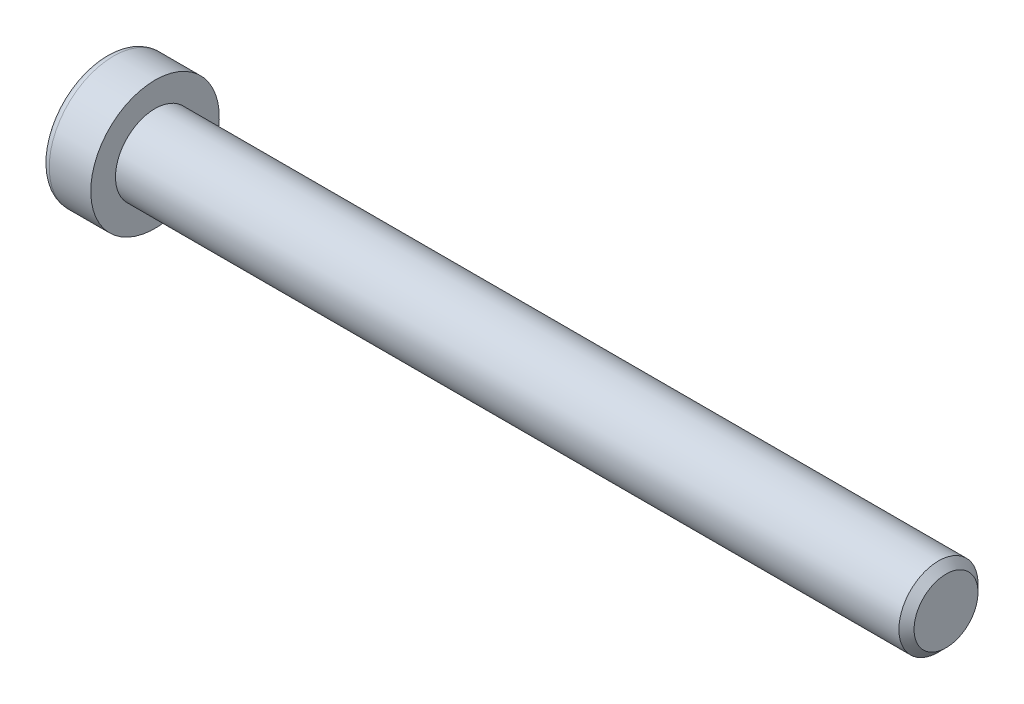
ISO-10303-21;
HEADER;
FILE_DESCRIPTION(('STEP AP214'),'2;1');
FILE_NAME('part.step','',(''),(''),'','','');
FILE_SCHEMA(('AUTOMOTIVE_DESIGN { 1 0 10303 214 1 1 1 1 }'));
ENDSEC;
DATA;
#1=APPLICATION_CONTEXT('core data for automotive mechanical design processes');
#2=APPLICATION_PROTOCOL_DEFINITION('international standard','automotive_design',2000,#1);
#3=PRODUCT_CONTEXT('',#1,'mechanical');
#4=PRODUCT('Part','Part','',(#3));
#5=PRODUCT_RELATED_PRODUCT_CATEGORY('part','',(#4));
#6=PRODUCT_DEFINITION_FORMATION('','',#4);
#7=PRODUCT_DEFINITION_CONTEXT('part definition',#1,'design');
#8=PRODUCT_DEFINITION('design','',#6,#7);
#9=PRODUCT_DEFINITION_SHAPE('','',#8);
#10=(LENGTH_UNIT() NAMED_UNIT(*) SI_UNIT(.MILLI.,.METRE.));
#11=(NAMED_UNIT(*) PLANE_ANGLE_UNIT() SI_UNIT($,.RADIAN.));
#12=(NAMED_UNIT(*) SI_UNIT($,.STERADIAN.) SOLID_ANGLE_UNIT());
#13=UNCERTAINTY_MEASURE_WITH_UNIT(LENGTH_MEASURE(1.E-05),#10,'distance_accuracy_value','');
#14=(GEOMETRIC_REPRESENTATION_CONTEXT(3) GLOBAL_UNCERTAINTY_ASSIGNED_CONTEXT((#13)) GLOBAL_UNIT_ASSIGNED_CONTEXT((#10,
#11,#12)) REPRESENTATION_CONTEXT('',''));
#15=CARTESIAN_POINT('',(0.,0.,0.));
#16=DIRECTION('',(0.,0.,1.));
#17=DIRECTION('',(1.,0.,0.));
#18=AXIS2_PLACEMENT_3D('',#15,#16,#17);
#19=CARTESIAN_POINT('',(-1.21000000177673,0.,0.));
#20=DIRECTION('',(-1.,0.,0.));
#21=DIRECTION('',(0.,0.,1.));
#22=AXIS2_PLACEMENT_3D('',#19,#20,#21);
#23=CONICAL_SURFACE('',#22,2.90407185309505,1.04719754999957);
#24=CARTESIAN_POINT('',(0.466666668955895,5.6843418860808E-11,0.));
#25=VERTEX_POINT('',#24);
#26=VERTEX_LOOP('',#25);
#27=FACE_BOUND('',#26,.T.);
#28=CARTESIAN_POINT('',(-1.20000000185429,2.50000000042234,1.44337567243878));
#29=CARTESIAN_POINT('',(-1.16336943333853,2.50000000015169,1.31652043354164));
#30=CARTESIAN_POINT('',(-1.13005584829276,2.50000000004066,1.18857018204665));
#31=CARTESIAN_POINT('',(-1.07190798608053,2.49999999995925,0.93045430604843));
#32=CARTESIAN_POINT('',(-1.0470942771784,2.49999999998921,0.800284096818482));
#33=CARTESIAN_POINT('',(-1.00846995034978,2.50000000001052,0.541556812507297));
#34=CARTESIAN_POINT('',(-0.994402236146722,2.50000000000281,0.413039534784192));
#35=CARTESIAN_POINT('',(-0.977611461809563,2.4999999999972,0.155400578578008));
#36=CARTESIAN_POINT('',(-0.97487449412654,2.4999999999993,0.026279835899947));
#37=CARTESIAN_POINT('',(-0.980582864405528,2.50000000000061,-0.214968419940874));
#38=CARTESIAN_POINT('',(-0.987626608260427,2.50000000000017,-0.327132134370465));
#39=CARTESIAN_POINT('',(-1.00994662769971,2.49999999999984,-0.550728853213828));
#40=CARTESIAN_POINT('',(-1.02523052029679,2.49999999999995,-0.662161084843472));
#41=CARTESIAN_POINT('',(-1.06343729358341,2.50000000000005,-0.886218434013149));
#42=CARTESIAN_POINT('',(-1.0865220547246,2.50000000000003,-0.998815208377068));
#43=CARTESIAN_POINT('',(-1.13891470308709,2.49999999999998,-1.22232986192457));
#44=CARTESIAN_POINT('',(-1.16821028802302,2.49999999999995,-1.33325060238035));
#45=CARTESIAN_POINT('',(-1.20000000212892,2.5,-1.44337567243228));
#46=B_SPLINE_CURVE_WITH_KNOTS('',3,(#28,#29,#30,#31,#32,#33,#34,#35,#36,#37,#38,#39,#40,#41,#42,
#43,#44,#45),.UNSPECIFIED.,.F.,.F.,(4,2,2,2,2,2,2,2,4),(0.,0.396270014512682,0.793492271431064,
1.18088450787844,1.56780111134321,1.90463472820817,2.2417802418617,2.586402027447,
2.93034746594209),.UNSPECIFIED.);
#47=CARTESIAN_POINT('',(-1.20000000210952,2.49999999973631,1.44337567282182));
#48=VERTEX_POINT('',#47);
#49=CARTESIAN_POINT('',(-1.20000000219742,2.5,-1.44337567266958));
#50=VERTEX_POINT('',#49);
#51=EDGE_CURVE('E20',#48,#50,#46,.T.);
#52=ORIENTED_EDGE('',*,*,#51,.T.);
#53=CARTESIAN_POINT('',(-1.20000000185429,2.4999999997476,-1.44337567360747));
#54=CARTESIAN_POINT('',(-1.16336943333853,2.3901401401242,-1.50680329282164));
#55=CARTESIAN_POINT('',(-1.13005584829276,2.27933197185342,-1.57077841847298));
#56=CARTESIAN_POINT('',(-1.07190798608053,2.05579706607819,-1.69983635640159));
#57=CARTESIAN_POINT('',(-1.0470942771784,1.9430663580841,-1.76492146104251));
#58=CARTESIAN_POINT('',(-1.00846995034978,1.71900195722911,-1.89428510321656));
#59=CARTESIAN_POINT('',(-0.994402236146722,1.60770272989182,-1.95854374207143));
#60=CARTESIAN_POINT('',(-0.977611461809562,1.38458084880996,-2.08736322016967));
#61=CARTESIAN_POINT('',(-0.974874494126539,1.27275900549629,-2.15192359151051));
#62=CARTESIAN_POINT('',(-0.980582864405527,1.06383188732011,-2.27254771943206));
#63=CARTESIAN_POINT('',(-0.987626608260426,0.966695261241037,-2.32862957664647));
#64=CARTESIAN_POINT('',(-1.00994662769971,0.773054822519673,-2.44042793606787));
#65=CARTESIAN_POINT('',(-1.02523052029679,0.676551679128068,-2.49614405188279));
#66=CARTESIAN_POINT('',(-1.06343729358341,0.482512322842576,-2.60817272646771));
#67=CARTESIAN_POINT('',(-1.0865220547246,0.385000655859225,-2.66447111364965));
#68=CARTESIAN_POINT('',(-1.13891470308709,0.191431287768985,-2.77622844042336));
#69=CARTESIAN_POINT('',(-1.16821028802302,0.0953711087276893,-2.83168881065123));
#70=CARTESIAN_POINT('',(-1.20000000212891,4.69203677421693E-10,-2.88675134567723));
#71=B_SPLINE_CURVE_WITH_KNOTS('',3,(#53,#54,#55,#56,#57,#58,#59,#60,#61,#62,#63,#64,#65,#66,#67,
#68,#69,#70),.UNSPECIFIED.,.F.,.F.,(4,2,2,2,2,2,2,2,4),(0.,0.396270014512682,0.793492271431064,
1.18088450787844,1.56780111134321,1.90463472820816,2.2417802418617,2.586402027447,
2.93034746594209),.UNSPECIFIED.);
#72=CARTESIAN_POINT('',(-1.20000000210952,0.,-2.88675134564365));
#73=VERTEX_POINT('',#72);
#74=EDGE_CURVE('E81',#50,#73,#71,.T.);
#75=ORIENTED_EDGE('',*,*,#74,.T.);
#76=CARTESIAN_POINT('',(-1.20000000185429,-6.74740305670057E-10,-2.88675134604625));
#77=CARTESIAN_POINT('',(-1.16336943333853,-0.109859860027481,-2.82332372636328));
#78=CARTESIAN_POINT('',(-1.13005584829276,-0.220668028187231,-2.75934860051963));
#79=CARTESIAN_POINT('',(-1.07190798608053,-0.44420293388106,-2.63029066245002));
#80=CARTESIAN_POINT('',(-1.0470942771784,-0.556933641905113,-2.565205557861));
#81=CARTESIAN_POINT('',(-1.00846995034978,-0.780998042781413,-2.43584191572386));
#82=CARTESIAN_POINT('',(-0.994402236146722,-0.892297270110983,-2.37158327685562));
#83=CARTESIAN_POINT('',(-0.977611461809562,-1.11541915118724,-2.24276379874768));
#84=CARTESIAN_POINT('',(-0.974874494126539,-1.22724099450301,-2.17820342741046));
#85=CARTESIAN_POINT('',(-0.980582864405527,-1.4361681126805,-2.05757929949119));
#86=CARTESIAN_POINT('',(-0.987626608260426,-1.53330473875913,-2.00149744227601));
#87=CARTESIAN_POINT('',(-1.00994662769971,-1.72694517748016,-1.88969908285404));
#88=CARTESIAN_POINT('',(-1.02523052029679,-1.82344832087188,-1.83398296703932));
#89=CARTESIAN_POINT('',(-1.06343729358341,-2.01748767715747,-1.72195429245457));
#90=CARTESIAN_POINT('',(-1.0865220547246,-2.1149993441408,-1.66565590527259));
#91=CARTESIAN_POINT('',(-1.13891470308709,-2.30856871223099,-1.55389857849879));
#92=CARTESIAN_POINT('',(-1.16821028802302,-2.40462889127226,-1.49843820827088));
#93=CARTESIAN_POINT('',(-1.20000000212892,-2.4999999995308,-1.44337567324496));
#94=B_SPLINE_CURVE_WITH_KNOTS('',3,(#76,#77,#78,#79,#80,#81,#82,#83,#84,#85,#86,#87,#88,#89,#90,
#91,#92,#93),.UNSPECIFIED.,.F.,.F.,(4,2,2,2,2,2,2,2,4),(0.,0.396270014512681,0.793492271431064,
1.18088450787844,1.56780111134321,1.90463472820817,2.2417802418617,2.58640202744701,
2.93034746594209),.UNSPECIFIED.);
#95=CARTESIAN_POINT('',(-1.20000000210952,-2.49999999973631,-1.44337567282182));
#96=VERTEX_POINT('',#95);
#97=EDGE_CURVE('E106',#73,#96,#94,.T.);
#98=ORIENTED_EDGE('',*,*,#97,.T.);
#99=CARTESIAN_POINT('',(-1.20000000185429,-2.50000000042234,-1.44337567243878));
#100=CARTESIAN_POINT('',(-1.16336943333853,-2.50000000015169,-1.31652043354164));
#101=CARTESIAN_POINT('',(-1.13005584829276,-2.50000000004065,-1.18857018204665));
#102=CARTESIAN_POINT('',(-1.07190798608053,-2.49999999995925,-0.930454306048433));
#103=CARTESIAN_POINT('',(-1.0470942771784,-2.49999999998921,-0.800284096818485));
#104=CARTESIAN_POINT('',(-1.00846995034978,-2.50000000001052,-0.5415568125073));
#105=CARTESIAN_POINT('',(-0.994402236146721,-2.5000000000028,-0.413039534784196));
#106=CARTESIAN_POINT('',(-0.977611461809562,-2.4999999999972,-0.155400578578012));
#107=CARTESIAN_POINT('',(-0.974874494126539,-2.4999999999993,-0.0262798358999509));
#108=CARTESIAN_POINT('',(-0.980582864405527,-2.50000000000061,0.214968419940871));
#109=CARTESIAN_POINT('',(-0.987626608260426,-2.50000000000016,0.327132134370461));
#110=CARTESIAN_POINT('',(-1.00994662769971,-2.49999999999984,0.550728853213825));
#111=CARTESIAN_POINT('',(-1.02523052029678,-2.49999999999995,0.662161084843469));
#112=CARTESIAN_POINT('',(-1.06343729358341,-2.50000000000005,0.886218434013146));
#113=CARTESIAN_POINT('',(-1.0865220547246,-2.50000000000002,0.998815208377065));
#114=CARTESIAN_POINT('',(-1.13891470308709,-2.49999999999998,1.22232986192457));
#115=CARTESIAN_POINT('',(-1.16821028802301,-2.49999999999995,1.33325060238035));
#116=CARTESIAN_POINT('',(-1.20000000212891,-2.5,1.44337567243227));
#117=B_SPLINE_CURVE_WITH_KNOTS('',3,(#99,#100,#101,#102,#103,#104,#105,#106,#107,#108,#109,#110,
#111,#112,#113,#114,#115,#116),.UNSPECIFIED.,.F.,.F.,(4,2,2,2,2,2,2,2,4),(0.,0.396270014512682,
0.793492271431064,1.18088450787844,1.56780111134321,1.90463472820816,2.2417802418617,
2.586402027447,2.93034746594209),.UNSPECIFIED.);
#118=CARTESIAN_POINT('',(-1.20000000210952,-2.49999999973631,1.44337567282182));
#119=VERTEX_POINT('',#118);
#120=EDGE_CURVE('E130',#96,#119,#117,.T.);
#121=ORIENTED_EDGE('',*,*,#120,.T.);
#122=CARTESIAN_POINT('',(-1.20000000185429,-2.4999999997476,1.44337567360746));
#123=CARTESIAN_POINT('',(-1.16336943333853,-2.39014014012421,1.50680329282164));
#124=CARTESIAN_POINT('',(-1.13005584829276,-2.27933197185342,1.57077841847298));
#125=CARTESIAN_POINT('',(-1.07190798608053,-2.05579706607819,1.69983635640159));
#126=CARTESIAN_POINT('',(-1.0470942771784,-1.9430663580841,1.76492146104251));
#127=CARTESIAN_POINT('',(-1.00846995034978,-1.71900195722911,1.89428510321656));
#128=CARTESIAN_POINT('',(-0.994402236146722,-1.60770272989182,1.95854374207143));
#129=CARTESIAN_POINT('',(-0.977611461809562,-1.38458084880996,2.08736322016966));
#130=CARTESIAN_POINT('',(-0.974874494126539,-1.27275900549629,2.15192359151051));
#131=CARTESIAN_POINT('',(-0.980582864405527,-1.06383188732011,2.27254771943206));
#132=CARTESIAN_POINT('',(-0.987626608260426,-0.966695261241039,2.32862957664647));
#133=CARTESIAN_POINT('',(-1.00994662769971,-0.773054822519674,2.44042793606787));
#134=CARTESIAN_POINT('',(-1.02523052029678,-0.676551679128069,2.49614405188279));
#135=CARTESIAN_POINT('',(-1.06343729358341,-0.482512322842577,2.60817272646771));
#136=CARTESIAN_POINT('',(-1.0865220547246,-0.385000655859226,2.66447111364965));
#137=CARTESIAN_POINT('',(-1.13891470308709,-0.191431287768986,2.77622844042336));
#138=CARTESIAN_POINT('',(-1.16821028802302,-0.0953711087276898,2.83168881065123));
#139=CARTESIAN_POINT('',(-1.20000000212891,-4.69203937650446E-10,2.88675134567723));
#140=B_SPLINE_CURVE_WITH_KNOTS('',3,(#122,#123,#124,#125,#126,#127,#128,#129,#130,#131,#132,
#133,#134,#135,#136,#137,#138,#139),.UNSPECIFIED.,.F.,.F.,(4,2,2,2,2,2,2,2,4),(0.,
0.396270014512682,0.793492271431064,1.18088450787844,1.56780111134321,1.90463472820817,
2.2417802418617,2.58640202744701,2.93034746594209),.UNSPECIFIED.);
#141=CARTESIAN_POINT('',(-1.20000000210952,0.,2.88675134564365));
#142=VERTEX_POINT('',#141);
#143=EDGE_CURVE('E138',#119,#142,#140,.T.);
#144=ORIENTED_EDGE('',*,*,#143,.T.);
#145=CARTESIAN_POINT('',(-1.20000000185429,6.74739340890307E-10,2.88675134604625));
#146=CARTESIAN_POINT('',(-1.16336943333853,0.10985986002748,2.82332372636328));
#147=CARTESIAN_POINT('',(-1.13005584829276,0.22066802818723,2.75934860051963));
#148=CARTESIAN_POINT('',(-1.07190798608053,0.444202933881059,2.63029066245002));
#149=CARTESIAN_POINT('',(-1.0470942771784,0.556933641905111,2.565205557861));
#150=CARTESIAN_POINT('',(-1.00846995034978,0.780998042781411,2.43584191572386));
#151=CARTESIAN_POINT('',(-0.994402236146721,0.892297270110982,2.37158327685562));
#152=CARTESIAN_POINT('',(-0.977611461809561,1.11541915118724,2.24276379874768));
#153=CARTESIAN_POINT('',(-0.974874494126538,1.227240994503,2.17820342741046));
#154=CARTESIAN_POINT('',(-0.980582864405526,1.4361681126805,2.05757929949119));
#155=CARTESIAN_POINT('',(-0.987626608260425,1.53330473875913,2.00149744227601));
#156=CARTESIAN_POINT('',(-1.00994662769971,1.72694517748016,1.88969908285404));
#157=CARTESIAN_POINT('',(-1.02523052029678,1.82344832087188,1.83398296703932));
#158=CARTESIAN_POINT('',(-1.06343729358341,2.01748767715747,1.72195429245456));
#159=CARTESIAN_POINT('',(-1.0865220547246,2.1149993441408,1.66565590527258));
#160=CARTESIAN_POINT('',(-1.13891470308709,2.30856871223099,1.55389857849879));
#161=CARTESIAN_POINT('',(-1.16821028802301,2.40462889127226,1.49843820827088));
#162=CARTESIAN_POINT('',(-1.20000000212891,2.4999999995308,1.44337567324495));
#163=B_SPLINE_CURVE_WITH_KNOTS('',3,(#145,#146,#147,#148,#149,#150,#151,#152,#153,#154,#155,
#156,#157,#158,#159,#160,#161,#162),.UNSPECIFIED.,.F.,.F.,(4,2,2,2,2,2,2,2,4),(0.,
0.396270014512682,0.793492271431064,1.18088450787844,1.56780111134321,1.90463472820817,
2.2417802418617,2.58640202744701,2.93034746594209),.UNSPECIFIED.);
#164=EDGE_CURVE('E83',#142,#48,#163,.T.);
#165=ORIENTED_EDGE('',*,*,#164,.T.);
#166=EDGE_LOOP('',(#52,#75,#98,#121,#144,#165));
#167=FACE_BOUND('',#166,.T.);
#168=ADVANCED_FACE('F16',(#27,#167),#23,.F.);
#169=CARTESIAN_POINT('',(-5.,2.5,1.44337567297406));
#170=DIRECTION('',(0.,1.,0.));
#171=DIRECTION('',(0.,0.,1.));
#172=AXIS2_PLACEMENT_3D('',#169,#170,#171);
#173=PLANE('',#172);
#174=DIRECTION('',(1.,0.,0.));
#175=VECTOR('',#174,1.);
#176=CARTESIAN_POINT('',(-5.,2.5,1.44337567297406));
#177=LINE('',#176,#175);
#178=CARTESIAN_POINT('',(-5.,2.5,1.44337567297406));
#179=VERTEX_POINT('',#178);
#180=EDGE_CURVE('E85',#48,#179,#177,.F.);
#181=ORIENTED_EDGE('',*,*,#180,.T.);
#182=DIRECTION('',(0.,0.,1.));
#183=VECTOR('',#182,1.);
#184=CARTESIAN_POINT('',(-5.,2.5,0.));
#185=LINE('',#184,#183);
#186=CARTESIAN_POINT('',(-5.,2.5,-1.44337567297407));
#187=VERTEX_POINT('',#186);
#188=EDGE_CURVE('E90',#187,#179,#185,.T.);
#189=ORIENTED_EDGE('',*,*,#188,.F.);
#190=DIRECTION('',(1.,0.,0.));
#191=VECTOR('',#190,1.);
#192=CARTESIAN_POINT('',(-5.,2.5,-1.44337567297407));
#193=LINE('',#192,#191);
#194=EDGE_CURVE('E88',#187,#50,#193,.T.);
#195=ORIENTED_EDGE('',*,*,#194,.T.);
#196=ORIENTED_EDGE('',*,*,#51,.F.);
#197=EDGE_LOOP('',(#181,#189,#195,#196));
#198=FACE_BOUND('',#197,.T.);
#199=ADVANCED_FACE('F77',(#198),#173,.F.);
#200=CARTESIAN_POINT('',(-5.,0.,2.88675134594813));
#201=DIRECTION('',(0.,0.500000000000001,0.866025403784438));
#202=DIRECTION('',(0.,-0.866025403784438,0.500000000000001));
#203=AXIS2_PLACEMENT_3D('',#200,#201,#202);
#204=PLANE('',#203);
#205=DIRECTION('',(1.,0.,0.));
#206=VECTOR('',#205,1.);
#207=CARTESIAN_POINT('',(-5.,0.,2.88675134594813));
#208=LINE('',#207,#206);
#209=CARTESIAN_POINT('',(-5.,0.,2.88675134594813));
#210=VERTEX_POINT('',#209);
#211=EDGE_CURVE('E142',#142,#210,#208,.F.);
#212=ORIENTED_EDGE('',*,*,#211,.T.);
#213=DIRECTION('',(0.,-0.866025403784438,0.500000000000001));
#214=VECTOR('',#213,1.);
#215=CARTESIAN_POINT('',(-5.,2.5,1.44337567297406));
#216=LINE('',#215,#214);
#217=EDGE_CURVE('E96',#179,#210,#216,.T.);
#218=ORIENTED_EDGE('',*,*,#217,.F.);
#219=ORIENTED_EDGE('',*,*,#180,.F.);
#220=ORIENTED_EDGE('',*,*,#164,.F.);
#221=EDGE_LOOP('',(#212,#218,#219,#220));
#222=FACE_BOUND('',#221,.T.);
#223=ADVANCED_FACE('F146',(#222),#204,.F.);
#224=CARTESIAN_POINT('',(-5.,-2.5,1.44337567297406));
#225=DIRECTION('',(0.,-0.5,0.866025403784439));
#226=DIRECTION('',(0.,-0.866025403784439,-0.5));
#227=AXIS2_PLACEMENT_3D('',#224,#225,#226);
#228=PLANE('',#227);
#229=DIRECTION('',(1.,0.,0.));
#230=VECTOR('',#229,1.);
#231=CARTESIAN_POINT('',(-5.,-2.5,1.44337567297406));
#232=LINE('',#231,#230);
#233=CARTESIAN_POINT('',(-5.,-2.5,1.44337567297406));
#234=VERTEX_POINT('',#233);
#235=EDGE_CURVE('E137',#119,#234,#232,.F.);
#236=ORIENTED_EDGE('',*,*,#235,.T.);
#237=DIRECTION('',(0.,-0.866025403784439,-0.5));
#238=VECTOR('',#237,1.);
#239=CARTESIAN_POINT('',(-5.,0.,2.88675134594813));
#240=LINE('',#239,#238);
#241=EDGE_CURVE('E224',#210,#234,#240,.T.);
#242=ORIENTED_EDGE('',*,*,#241,.F.);
#243=ORIENTED_EDGE('',*,*,#211,.F.);
#244=ORIENTED_EDGE('',*,*,#143,.F.);
#245=EDGE_LOOP('',(#236,#242,#243,#244));
#246=FACE_BOUND('',#245,.T.);
#247=ADVANCED_FACE('F126',(#246),#228,.F.);
#248=CARTESIAN_POINT('',(-5.,-2.5,-1.44337567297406));
#249=DIRECTION('',(0.,-1.,0.));
#250=DIRECTION('',(0.,0.,-1.));
#251=AXIS2_PLACEMENT_3D('',#248,#249,#250);
#252=PLANE('',#251);
#253=DIRECTION('',(1.,0.,0.));
#254=VECTOR('',#253,1.);
#255=CARTESIAN_POINT('',(-5.,-2.5,-1.44337567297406));
#256=LINE('',#255,#254);
#257=CARTESIAN_POINT('',(-5.,-2.5,-1.44337567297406));
#258=VERTEX_POINT('',#257);
#259=EDGE_CURVE('E136',#96,#258,#256,.F.);
#260=ORIENTED_EDGE('',*,*,#259,.T.);
#261=DIRECTION('',(0.,0.,1.));
#262=VECTOR('',#261,1.);
#263=CARTESIAN_POINT('',(-5.,-2.5,0.));
#264=LINE('',#263,#262);
#265=EDGE_CURVE('E221',#234,#258,#264,.F.);
#266=ORIENTED_EDGE('',*,*,#265,.F.);
#267=ORIENTED_EDGE('',*,*,#235,.F.);
#268=ORIENTED_EDGE('',*,*,#120,.F.);
#269=EDGE_LOOP('',(#260,#266,#267,#268));
#270=FACE_BOUND('',#269,.T.);
#271=ADVANCED_FACE('F122',(#270),#252,.F.);
#272=CARTESIAN_POINT('',(-5.,0.,-2.88675134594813));
#273=DIRECTION('',(0.,-0.5,-0.866025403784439));
#274=DIRECTION('',(0.,0.866025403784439,-0.5));
#275=AXIS2_PLACEMENT_3D('',#272,#273,#274);
#276=PLANE('',#275);
#277=DIRECTION('',(1.,0.,0.));
#278=VECTOR('',#277,1.);
#279=CARTESIAN_POINT('',(-5.,0.,-2.88675134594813));
#280=LINE('',#279,#278);
#281=CARTESIAN_POINT('',(-5.,0.,-2.88675134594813));
#282=VERTEX_POINT('',#281);
#283=EDGE_CURVE('E39',#73,#282,#280,.F.);
#284=ORIENTED_EDGE('',*,*,#283,.T.);
#285=DIRECTION('',(0.,0.866025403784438,-0.500000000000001));
#286=VECTOR('',#285,1.);
#287=CARTESIAN_POINT('',(-5.,-2.5,-1.44337567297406));
#288=LINE('',#287,#286);
#289=EDGE_CURVE('E218',#258,#282,#288,.T.);
#290=ORIENTED_EDGE('',*,*,#289,.F.);
#291=ORIENTED_EDGE('',*,*,#259,.F.);
#292=ORIENTED_EDGE('',*,*,#97,.F.);
#293=EDGE_LOOP('',(#284,#290,#291,#292));
#294=FACE_BOUND('',#293,.T.);
#295=ADVANCED_FACE('F116',(#294),#276,.F.);
#296=CARTESIAN_POINT('',(-5.,2.5,-1.44337567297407));
#297=DIRECTION('',(0.,0.5,-0.866025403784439));
#298=DIRECTION('',(0.,0.866025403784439,0.5));
#299=AXIS2_PLACEMENT_3D('',#296,#297,#298);
#300=PLANE('',#299);
#301=ORIENTED_EDGE('',*,*,#194,.F.);
#302=DIRECTION('',(0.,0.866025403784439,0.5));
#303=VECTOR('',#302,1.);
#304=CARTESIAN_POINT('',(-5.,0.,-2.88675134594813));
#305=LINE('',#304,#303);
#306=EDGE_CURVE('E216',#282,#187,#305,.T.);
#307=ORIENTED_EDGE('',*,*,#306,.F.);
#308=ORIENTED_EDGE('',*,*,#283,.F.);
#309=ORIENTED_EDGE('',*,*,#74,.F.);
#310=EDGE_LOOP('',(#301,#307,#308,#309));
#311=FACE_BOUND('',#310,.T.);
#312=ADVANCED_FACE('F94',(#311),#300,.F.);
#313=CARTESIAN_POINT('',(-5.,4.69337567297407,0.));
#314=DIRECTION('',(-1.,0.,0.));
#315=DIRECTION('',(0.,0.,1.));
#316=AXIS2_PLACEMENT_3D('',#313,#314,#315);
#317=PLANE('',#316);
#318=ORIENTED_EDGE('',*,*,#289,.T.);
#319=ORIENTED_EDGE('',*,*,#306,.T.);
#320=ORIENTED_EDGE('',*,*,#188,.T.);
#321=ORIENTED_EDGE('',*,*,#217,.T.);
#322=ORIENTED_EDGE('',*,*,#241,.T.);
#323=ORIENTED_EDGE('',*,*,#265,.T.);
#324=EDGE_LOOP('',(#318,#319,#320,#321,#322,#323));
#325=FACE_BOUND('',#324,.T.);
#326=CARTESIAN_POINT('',(-5.,0.,0.));
#327=DIRECTION('',(1.,0.,0.));
#328=DIRECTION('',(0.,1.,0.));
#329=AXIS2_PLACEMENT_3D('',#326,#327,#328);
#330=CIRCLE('',#329,5.7);
#331=CARTESIAN_POINT('',(-5.,5.7,0.));
#332=VERTEX_POINT('',#331);
#333=EDGE_CURVE('E193',#332,#332,#330,.T.);
#334=ORIENTED_EDGE('',*,*,#333,.F.);
#335=EDGE_LOOP('',(#334));
#336=FACE_BOUND('',#335,.T.);
#337=ADVANCED_FACE('F115',(#325,#336),#317,.T.);
#338=CARTESIAN_POINT('',(-4.2,0.,0.));
#339=DIRECTION('',(1.,0.,0.));
#340=DIRECTION('',(0.,0.,-1.));
#341=AXIS2_PLACEMENT_3D('',#338,#339,#340);
#342=TOROIDAL_SURFACE('',#341,5.7,0.8);
#343=CARTESIAN_POINT('',(-4.2,0.,0.));
#344=DIRECTION('',(1.,0.,0.));
#345=DIRECTION('',(0.,1.,0.));
#346=AXIS2_PLACEMENT_3D('',#343,#344,#345);
#347=CIRCLE('',#346,6.5);
#348=CARTESIAN_POINT('',(-4.2,6.5,0.));
#349=VERTEX_POINT('',#348);
#350=EDGE_CURVE('E237',#349,#349,#347,.T.);
#351=ORIENTED_EDGE('',*,*,#350,.F.);
#352=EDGE_LOOP('',(#351));
#353=FACE_BOUND('',#352,.T.);
#354=ORIENTED_EDGE('',*,*,#333,.T.);
#355=EDGE_LOOP('',(#354));
#356=FACE_BOUND('',#355,.T.);
#357=ADVANCED_FACE('F177',(#353,#356),#342,.T.);
#358=CARTESIAN_POINT('',(-2.5,0.,0.));
#359=DIRECTION('',(1.,0.,0.));
#360=DIRECTION('',(0.,1.,0.));
#361=AXIS2_PLACEMENT_3D('',#358,#359,#360);
#362=CYLINDRICAL_SURFACE('',#361,6.5);
#363=ORIENTED_EDGE('',*,*,#350,.T.);
#364=EDGE_LOOP('',(#363));
#365=FACE_BOUND('',#364,.T.);
#366=CARTESIAN_POINT('',(0.,0.,0.));
#367=DIRECTION('',(1.,0.,0.));
#368=DIRECTION('',(0.,1.,0.));
#369=AXIS2_PLACEMENT_3D('',#366,#367,#368);
#370=CIRCLE('',#369,6.5);
#371=CARTESIAN_POINT('',(0.,6.5,0.));
#372=VERTEX_POINT('',#371);
#373=EDGE_CURVE('E104',#372,#372,#370,.T.);
#374=ORIENTED_EDGE('',*,*,#373,.F.);
#375=EDGE_LOOP('',(#374));
#376=FACE_BOUND('',#375,.T.);
#377=ADVANCED_FACE('F174',(#365,#376),#362,.T.);
#378=CARTESIAN_POINT('',(80.,2.,0.));
#379=DIRECTION('',(1.,0.,0.));
#380=DIRECTION('',(0.,0.,-1.));
#381=AXIS2_PLACEMENT_3D('',#378,#379,#380);
#382=PLANE('',#381);
#383=CARTESIAN_POINT('',(80.000000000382,0.,0.));
#384=DIRECTION('',(-1.,0.,0.));
#385=DIRECTION('',(0.,0.,1.));
#386=AXIS2_PLACEMENT_3D('',#383,#384,#385);
#387=CIRCLE('',#386,3.23318750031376);
#388=CARTESIAN_POINT('',(80.000000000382,0.,3.23318750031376));
#389=VERTEX_POINT('',#388);
#390=EDGE_CURVE('E230',#389,#389,#387,.T.);
#391=ORIENTED_EDGE('',*,*,#390,.F.);
#392=EDGE_LOOP('',(#391));
#393=FACE_BOUND('',#392,.T.);
#394=ADVANCED_FACE('F170',(#393),#382,.T.);
#395=CARTESIAN_POINT('',(0.,5.25,0.));
#396=DIRECTION('',(1.,0.,0.));
#397=DIRECTION('',(0.,0.,-1.));
#398=AXIS2_PLACEMENT_3D('',#395,#396,#397);
#399=PLANE('',#398);
#400=CARTESIAN_POINT('',(0.,0.,0.));
#401=DIRECTION('',(1.,0.,0.));
#402=DIRECTION('',(0.,1.,0.));
#403=AXIS2_PLACEMENT_3D('',#400,#401,#402);
#404=CIRCLE('',#403,4.00000000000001);
#405=CARTESIAN_POINT('',(0.,4.00000000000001,0.));
#406=VERTEX_POINT('',#405);
#407=EDGE_CURVE('E30',#406,#406,#404,.T.);
#408=ORIENTED_EDGE('',*,*,#407,.F.);
#409=EDGE_LOOP('',(#408));
#410=FACE_BOUND('',#409,.T.);
#411=ORIENTED_EDGE('',*,*,#373,.T.);
#412=EDGE_LOOP('',(#411));
#413=FACE_BOUND('',#412,.T.);
#414=ADVANCED_FACE('F163',(#410,#413),#399,.T.);
#415=CARTESIAN_POINT('',(79.2331874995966,0.,0.));
#416=DIRECTION('',(-1.,0.,0.));
#417=DIRECTION('',(0.,0.,1.));
#418=AXIS2_PLACEMENT_3D('',#415,#416,#417);
#419=CONICAL_SURFACE('',#418,3.99999999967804,0.78539816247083);
#420=ORIENTED_EDGE('',*,*,#390,.T.);
#421=EDGE_LOOP('',(#420));
#422=FACE_BOUND('',#421,.T.);
#423=CARTESIAN_POINT('',(79.2331875,0.,0.));
#424=DIRECTION('',(1.,0.,0.));
#425=DIRECTION('',(0.,1.,0.));
#426=AXIS2_PLACEMENT_3D('',#423,#424,#425);
#427=CIRCLE('',#426,4.00000000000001);
#428=CARTESIAN_POINT('',(79.2331875,4.00000000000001,0.));
#429=VERTEX_POINT('',#428);
#430=EDGE_CURVE('E11',#429,#429,#427,.F.);
#431=ORIENTED_EDGE('',*,*,#430,.F.);
#432=EDGE_LOOP('',(#431));
#433=FACE_BOUND('',#432,.T.);
#434=ADVANCED_FACE('F157',(#422,#433),#419,.T.);
#435=CARTESIAN_POINT('',(69.,0.,0.));
#436=DIRECTION('',(1.,0.,0.));
#437=DIRECTION('',(0.,1.,0.));
#438=AXIS2_PLACEMENT_3D('',#435,#436,#437);
#439=CYLINDRICAL_SURFACE('',#438,4.00000000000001);
#440=ORIENTED_EDGE('',*,*,#430,.T.);
#441=EDGE_LOOP('',(#440));
#442=FACE_BOUND('',#441,.T.);
#443=ORIENTED_EDGE('',*,*,#407,.T.);
#444=EDGE_LOOP('',(#443));
#445=FACE_BOUND('',#444,.T.);
#446=ADVANCED_FACE('F155',(#442,#445),#439,.T.);
#447=CLOSED_SHELL('',(#168,#199,#223,#247,#271,#295,#312,#337,#357,#377,#394,#414,#434,#446));
#448=MANIFOLD_SOLID_BREP('B1',#447);
#449=ADVANCED_BREP_SHAPE_REPRESENTATION('',(#18,#448),#14);
#450=SHAPE_DEFINITION_REPRESENTATION(#9,#449);
ENDSEC;
END-ISO-10303-21;
